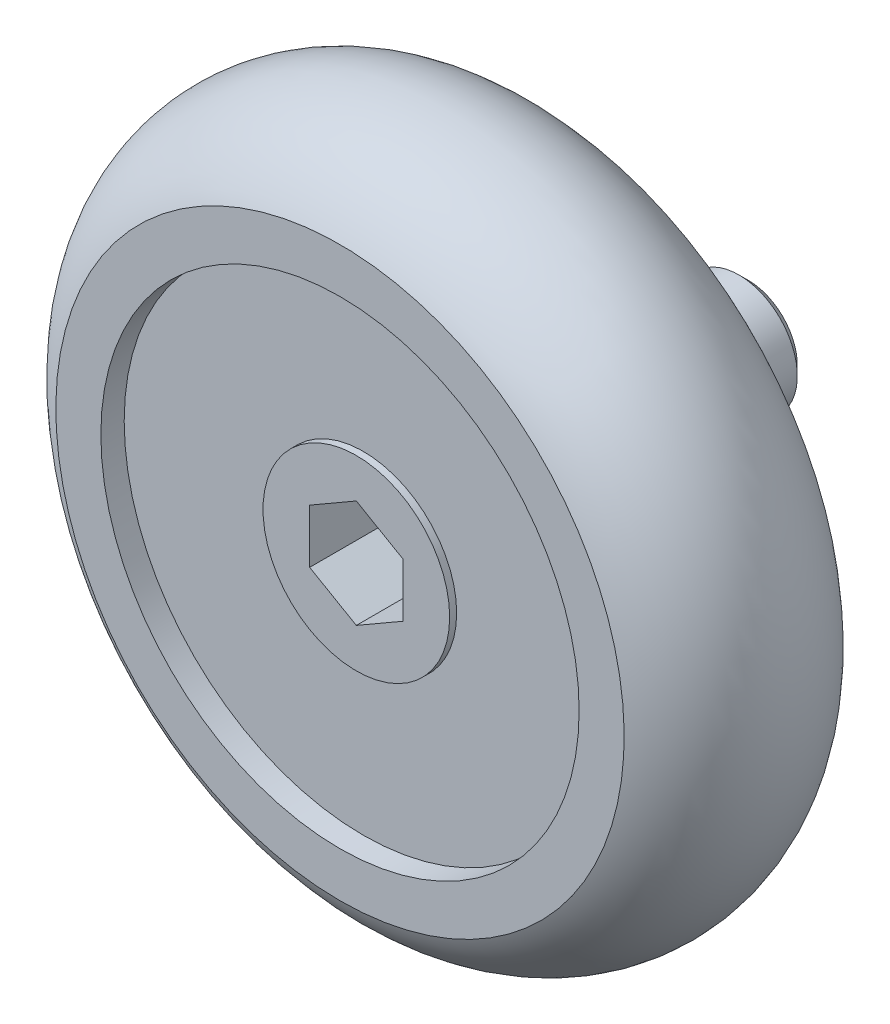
ISO-10303-21;
HEADER;
FILE_DESCRIPTION(('STEP AP214'),'2;1');
FILE_NAME('part.step','',(''),(''),'','','');
FILE_SCHEMA(('AUTOMOTIVE_DESIGN { 1 0 10303 214 1 1 1 1 }'));
ENDSEC;
DATA;
#1=APPLICATION_CONTEXT('core data for automotive mechanical design processes');
#2=APPLICATION_PROTOCOL_DEFINITION('international standard','automotive_design',2000,#1);
#3=PRODUCT_CONTEXT('',#1,'mechanical');
#4=PRODUCT('Part','Part','',(#3));
#5=PRODUCT_RELATED_PRODUCT_CATEGORY('part','',(#4));
#6=PRODUCT_DEFINITION_FORMATION('','',#4);
#7=PRODUCT_DEFINITION_CONTEXT('part definition',#1,'design');
#8=PRODUCT_DEFINITION('design','',#6,#7);
#9=PRODUCT_DEFINITION_SHAPE('','',#8);
#10=(LENGTH_UNIT() NAMED_UNIT(*) SI_UNIT(.MILLI.,.METRE.));
#11=(NAMED_UNIT(*) PLANE_ANGLE_UNIT() SI_UNIT($,.RADIAN.));
#12=(NAMED_UNIT(*) SI_UNIT($,.STERADIAN.) SOLID_ANGLE_UNIT());
#13=UNCERTAINTY_MEASURE_WITH_UNIT(LENGTH_MEASURE(1.E-05),#10,'distance_accuracy_value','');
#14=(GEOMETRIC_REPRESENTATION_CONTEXT(3) GLOBAL_UNCERTAINTY_ASSIGNED_CONTEXT((#13)) GLOBAL_UNIT_ASSIGNED_CONTEXT((#10,
#11,#12)) REPRESENTATION_CONTEXT('',''));
#15=CARTESIAN_POINT('',(0.,0.,0.));
#16=DIRECTION('',(0.,0.,1.));
#17=DIRECTION('',(1.,0.,0.));
#18=AXIS2_PLACEMENT_3D('',#15,#16,#17);
#19=CARTESIAN_POINT('',(0.,12.1794490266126,0.500000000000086));
#20=DIRECTION('',(0.,0.,-1.));
#21=DIRECTION('',(-1.,0.,0.));
#22=AXIS2_PLACEMENT_3D('',#19,#20,#21);
#23=PLANE('',#22);
#24=CARTESIAN_POINT('',(0.,0.,0.500000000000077));
#25=DIRECTION('',(0.,0.,1.));
#26=DIRECTION('',(0.,-1.,0.));
#27=AXIS2_PLACEMENT_3D('',#24,#25,#26);
#28=CIRCLE('',#27,12.1794494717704);
#29=CARTESIAN_POINT('',(0.,-12.1794494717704,0.500000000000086));
#30=VERTEX_POINT('',#29);
#31=EDGE_CURVE('E117',#30,#30,#28,.T.);
#32=ORIENTED_EDGE('',*,*,#31,.F.);
#33=EDGE_LOOP('',(#32));
#34=FACE_BOUND('',#33,.T.);
#35=CARTESIAN_POINT('',(0.,0.,0.50000000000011));
#36=DIRECTION('',(0.,0.,1.));
#37=DIRECTION('',(1.,0.,0.));
#38=AXIS2_PLACEMENT_3D('',#35,#36,#37);
#39=CIRCLE('',#38,10.25);
#40=CARTESIAN_POINT('',(10.25,0.,0.50000000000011));
#41=VERTEX_POINT('',#40);
#42=EDGE_CURVE('E9',#41,#41,#39,.T.);
#43=ORIENTED_EDGE('',*,*,#42,.T.);
#44=EDGE_LOOP('',(#43));
#45=FACE_BOUND('',#44,.T.);
#46=ADVANCED_FACE('F14',(#34,#45),#23,.T.);
#47=CARTESIAN_POINT('',(0.,0.,12.5));
#48=DIRECTION('',(0.,0.,1.));
#49=DIRECTION('',(1.,0.,0.));
#50=AXIS2_PLACEMENT_3D('',#47,#48,#49);
#51=CYLINDRICAL_SURFACE('',#50,10.25);
#52=CARTESIAN_POINT('',(0.,0.,1.5));
#53=DIRECTION('',(0.,0.,1.));
#54=DIRECTION('',(1.,0.,0.));
#55=AXIS2_PLACEMENT_3D('',#52,#53,#54);
#56=CIRCLE('',#55,10.25);
#57=CARTESIAN_POINT('',(10.25,0.,1.5));
#58=VERTEX_POINT('',#57);
#59=EDGE_CURVE('E21',#58,#58,#56,.T.);
#60=ORIENTED_EDGE('',*,*,#59,.T.);
#61=EDGE_LOOP('',(#60));
#62=FACE_BOUND('',#61,.T.);
#63=ORIENTED_EDGE('',*,*,#42,.F.);
#64=EDGE_LOOP('',(#63));
#65=FACE_BOUND('',#64,.T.);
#66=ADVANCED_FACE('F137',(#62,#65),#51,.F.);
#67=CARTESIAN_POINT('',(0.,5.1,1.5));
#68=DIRECTION('',(0.,0.,-1.));
#69=DIRECTION('',(-1.,0.,0.));
#70=AXIS2_PLACEMENT_3D('',#67,#68,#69);
#71=PLANE('',#70);
#72=ORIENTED_EDGE('',*,*,#59,.F.);
#73=EDGE_LOOP('',(#72));
#74=FACE_BOUND('',#73,.T.);
#75=CARTESIAN_POINT('',(0.,0.,1.5));
#76=DIRECTION('',(0.,0.,-1.));
#77=DIRECTION('',(-1.,0.,0.));
#78=AXIS2_PLACEMENT_3D('',#75,#76,#77);
#79=CIRCLE('',#78,5.);
#80=CARTESIAN_POINT('',(-5.,0.,1.5));
#81=VERTEX_POINT('',#80);
#82=EDGE_CURVE('E85',#81,#81,#79,.F.);
#83=ORIENTED_EDGE('',*,*,#82,.T.);
#84=EDGE_LOOP('',(#83));
#85=FACE_BOUND('',#84,.T.);
#86=ADVANCED_FACE('F140',(#74,#85),#71,.T.);
#87=CARTESIAN_POINT('',(0.,0.,5.));
#88=DIRECTION('',(0.,0.,1.));
#89=DIRECTION('',(0.,-1.,0.));
#90=AXIS2_PLACEMENT_3D('',#87,#88,#89);
#91=TOROIDAL_SURFACE('',#90,10.,5.);
#92=ORIENTED_EDGE('',*,*,#31,.T.);
#93=EDGE_LOOP('',(#92));
#94=FACE_BOUND('',#93,.T.);
#95=CARTESIAN_POINT('',(0.,0.,9.5));
#96=DIRECTION('',(0.,0.,1.));
#97=DIRECTION('',(0.,-1.,0.));
#98=AXIS2_PLACEMENT_3D('',#95,#96,#97);
#99=CIRCLE('',#98,12.1794494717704);
#100=CARTESIAN_POINT('',(0.,-12.1794494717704,9.50000000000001));
#101=VERTEX_POINT('',#100);
#102=EDGE_CURVE('E120',#101,#101,#99,.T.);
#103=ORIENTED_EDGE('',*,*,#102,.F.);
#104=EDGE_LOOP('',(#103));
#105=FACE_BOUND('',#104,.T.);
#106=ADVANCED_FACE('F143',(#94,#105),#91,.T.);
#107=CARTESIAN_POINT('',(0.,4.0000000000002,8.8));
#108=DIRECTION('',(0.,0.,1.));
#109=DIRECTION('',(1.,0.,0.));
#110=AXIS2_PLACEMENT_3D('',#107,#108,#109);
#111=PLANE('',#110);
#112=CARTESIAN_POINT('',(0.,0.,8.8));
#113=DIRECTION('',(0.,0.,1.));
#114=DIRECTION('',(1.,0.,0.));
#115=AXIS2_PLACEMENT_3D('',#112,#113,#114);
#116=CIRCLE('',#115,4.0000000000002);
#117=CARTESIAN_POINT('',(4.0000000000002,0.,8.8));
#118=VERTEX_POINT('',#117);
#119=EDGE_CURVE('E132',#118,#118,#116,.T.);
#120=ORIENTED_EDGE('',*,*,#119,.T.);
#121=EDGE_LOOP('',(#120));
#122=FACE_BOUND('',#121,.T.);
#123=DIRECTION('',(0.866025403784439,-0.5,0.));
#124=VECTOR('',#123,1.);
#125=CARTESIAN_POINT('',(-2.,-1.15470053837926,8.8));
#126=LINE('',#125,#124);
#127=CARTESIAN_POINT('',(-2.,-1.15470053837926,8.8));
#128=VERTEX_POINT('',#127);
#129=CARTESIAN_POINT('',(0.,-2.30940107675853,8.8));
#130=VERTEX_POINT('',#129);
#131=EDGE_CURVE('E70',#128,#130,#126,.T.);
#132=ORIENTED_EDGE('',*,*,#131,.F.);
#133=DIRECTION('',(0.,-1.,0.));
#134=VECTOR('',#133,1.);
#135=CARTESIAN_POINT('',(-2.,1.15470053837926,8.8));
#136=LINE('',#135,#134);
#137=CARTESIAN_POINT('',(-2.,1.15470053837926,8.8));
#138=VERTEX_POINT('',#137);
#139=EDGE_CURVE('E64',#138,#128,#136,.T.);
#140=ORIENTED_EDGE('',*,*,#139,.F.);
#141=DIRECTION('',(-0.866025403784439,-0.5,0.));
#142=VECTOR('',#141,1.);
#143=CARTESIAN_POINT('',(0.,2.30940107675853,8.8));
#144=LINE('',#143,#142);
#145=CARTESIAN_POINT('',(0.,2.30940107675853,8.8));
#146=VERTEX_POINT('',#145);
#147=EDGE_CURVE('E67',#146,#138,#144,.T.);
#148=ORIENTED_EDGE('',*,*,#147,.F.);
#149=DIRECTION('',(-0.866025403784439,0.5,0.));
#150=VECTOR('',#149,1.);
#151=CARTESIAN_POINT('',(2.,1.15470053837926,8.8));
#152=LINE('',#151,#150);
#153=CARTESIAN_POINT('',(2.,1.15470053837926,8.8));
#154=VERTEX_POINT('',#153);
#155=EDGE_CURVE('E84',#154,#146,#152,.T.);
#156=ORIENTED_EDGE('',*,*,#155,.F.);
#157=DIRECTION('',(0.,1.,0.));
#158=VECTOR('',#157,1.);
#159=CARTESIAN_POINT('',(2.,-1.15470053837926,8.8));
#160=LINE('',#159,#158);
#161=CARTESIAN_POINT('',(2.,-1.15470053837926,8.8));
#162=VERTEX_POINT('',#161);
#163=EDGE_CURVE('E154',#162,#154,#160,.T.);
#164=ORIENTED_EDGE('',*,*,#163,.F.);
#165=DIRECTION('',(0.866025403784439,0.5,0.));
#166=VECTOR('',#165,1.);
#167=CARTESIAN_POINT('',(0.,-2.30940107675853,8.8));
#168=LINE('',#167,#166);
#169=EDGE_CURVE('E157',#130,#162,#168,.T.);
#170=ORIENTED_EDGE('',*,*,#169,.F.);
#171=EDGE_LOOP('',(#132,#140,#148,#156,#164,#170));
#172=FACE_BOUND('',#171,.T.);
#173=ADVANCED_FACE('F66',(#122,#172),#111,.T.);
#174=CARTESIAN_POINT('',(0.,0.,12.5));
#175=DIRECTION('',(0.,0.,1.));
#176=DIRECTION('',(1.,0.,0.));
#177=AXIS2_PLACEMENT_3D('',#174,#175,#176);
#178=CYLINDRICAL_SURFACE('',#177,4.0000000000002);
#179=CARTESIAN_POINT('',(0.,0.,8.49999999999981));
#180=DIRECTION('',(0.,0.,1.));
#181=DIRECTION('',(1.,0.,0.));
#182=AXIS2_PLACEMENT_3D('',#179,#180,#181);
#183=CIRCLE('',#182,4.0000000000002);
#184=CARTESIAN_POINT('',(4.0000000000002,0.,8.49999999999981));
#185=VERTEX_POINT('',#184);
#186=EDGE_CURVE('E129',#185,#185,#183,.T.);
#187=ORIENTED_EDGE('',*,*,#186,.T.);
#188=EDGE_LOOP('',(#187));
#189=FACE_BOUND('',#188,.T.);
#190=ORIENTED_EDGE('',*,*,#119,.F.);
#191=EDGE_LOOP('',(#190));
#192=FACE_BOUND('',#191,.T.);
#193=ADVANCED_FACE('F224',(#189,#192),#178,.T.);
#194=CARTESIAN_POINT('',(0.,10.25,8.5));
#195=DIRECTION('',(0.,0.,1.));
#196=DIRECTION('',(1.,0.,0.));
#197=AXIS2_PLACEMENT_3D('',#194,#195,#196);
#198=PLANE('',#197);
#199=CARTESIAN_POINT('',(0.,0.,8.5));
#200=DIRECTION('',(0.,0.,1.));
#201=DIRECTION('',(1.,0.,0.));
#202=AXIS2_PLACEMENT_3D('',#199,#200,#201);
#203=CIRCLE('',#202,10.25);
#204=CARTESIAN_POINT('',(10.25,0.,8.5));
#205=VERTEX_POINT('',#204);
#206=EDGE_CURVE('E126',#205,#205,#203,.T.);
#207=ORIENTED_EDGE('',*,*,#206,.T.);
#208=EDGE_LOOP('',(#207));
#209=FACE_BOUND('',#208,.T.);
#210=ORIENTED_EDGE('',*,*,#186,.F.);
#211=EDGE_LOOP('',(#210));
#212=FACE_BOUND('',#211,.T.);
#213=ADVANCED_FACE('F216',(#209,#212),#198,.T.);
#214=CARTESIAN_POINT('',(0.,0.,12.5));
#215=DIRECTION('',(0.,0.,1.));
#216=DIRECTION('',(1.,0.,0.));
#217=AXIS2_PLACEMENT_3D('',#214,#215,#216);
#218=CYLINDRICAL_SURFACE('',#217,10.25);
#219=CARTESIAN_POINT('',(0.,0.,9.5));
#220=DIRECTION('',(0.,0.,1.));
#221=DIRECTION('',(1.,0.,0.));
#222=AXIS2_PLACEMENT_3D('',#219,#220,#221);
#223=CIRCLE('',#222,10.25);
#224=CARTESIAN_POINT('',(10.25,0.,9.5));
#225=VERTEX_POINT('',#224);
#226=EDGE_CURVE('E123',#225,#225,#223,.T.);
#227=ORIENTED_EDGE('',*,*,#226,.T.);
#228=EDGE_LOOP('',(#227));
#229=FACE_BOUND('',#228,.T.);
#230=ORIENTED_EDGE('',*,*,#206,.F.);
#231=EDGE_LOOP('',(#230));
#232=FACE_BOUND('',#231,.T.);
#233=ADVANCED_FACE('F208',(#229,#232),#218,.F.);
#234=CARTESIAN_POINT('',(0.,12.1794489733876,9.5));
#235=DIRECTION('',(0.,0.,1.));
#236=DIRECTION('',(1.,0.,0.));
#237=AXIS2_PLACEMENT_3D('',#234,#235,#236);
#238=PLANE('',#237);
#239=ORIENTED_EDGE('',*,*,#226,.F.);
#240=EDGE_LOOP('',(#239));
#241=FACE_BOUND('',#240,.T.);
#242=ORIENTED_EDGE('',*,*,#102,.T.);
#243=EDGE_LOOP('',(#242));
#244=FACE_BOUND('',#243,.T.);
#245=ADVANCED_FACE('F206',(#241,#244),#238,.T.);
#246=CARTESIAN_POINT('',(-2.,1.15470053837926,16.4376261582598));
#247=DIRECTION('',(1.,0.,0.));
#248=DIRECTION('',(0.,0.,-1.));
#249=AXIS2_PLACEMENT_3D('',#246,#247,#248);
#250=PLANE('',#249);
#251=DIRECTION('',(0.,0.,-1.));
#252=VECTOR('',#251,1.);
#253=CARTESIAN_POINT('',(-2.,1.15470053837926,16.4376261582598));
#254=LINE('',#253,#252);
#255=CARTESIAN_POINT('',(-2.,1.15470053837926,5.3));
#256=VERTEX_POINT('',#255);
#257=EDGE_CURVE('E80',#138,#256,#254,.T.);
#258=ORIENTED_EDGE('',*,*,#257,.F.);
#259=ORIENTED_EDGE('',*,*,#139,.T.);
#260=DIRECTION('',(0.,0.,-1.));
#261=VECTOR('',#260,1.);
#262=CARTESIAN_POINT('',(-2.,-1.15470053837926,16.4376261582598));
#263=LINE('',#262,#261);
#264=CARTESIAN_POINT('',(-2.,-1.15470053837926,5.3));
#265=VERTEX_POINT('',#264);
#266=EDGE_CURVE('E89',#128,#265,#263,.T.);
#267=ORIENTED_EDGE('',*,*,#266,.T.);
#268=DIRECTION('',(0.,-1.,0.));
#269=VECTOR('',#268,1.);
#270=CARTESIAN_POINT('',(-2.,1.15470053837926,5.3));
#271=LINE('',#270,#269);
#272=EDGE_CURVE('E88',#256,#265,#271,.T.);
#273=ORIENTED_EDGE('',*,*,#272,.F.);
#274=EDGE_LOOP('',(#258,#259,#267,#273));
#275=FACE_BOUND('',#274,.T.);
#276=ADVANCED_FACE('F87',(#275),#250,.T.);
#277=CARTESIAN_POINT('',(0.,2.30940107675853,16.4376261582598));
#278=DIRECTION('',(0.5,-0.866025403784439,0.));
#279=DIRECTION('',(0.866025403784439,0.5,0.));
#280=AXIS2_PLACEMENT_3D('',#277,#278,#279);
#281=PLANE('',#280);
#282=DIRECTION('',(0.,0.,-1.));
#283=VECTOR('',#282,1.);
#284=CARTESIAN_POINT('',(0.,2.30940107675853,16.4376261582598));
#285=LINE('',#284,#283);
#286=CARTESIAN_POINT('',(0.,2.30940107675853,5.3));
#287=VERTEX_POINT('',#286);
#288=EDGE_CURVE('E82',#146,#287,#285,.T.);
#289=ORIENTED_EDGE('',*,*,#288,.F.);
#290=ORIENTED_EDGE('',*,*,#147,.T.);
#291=ORIENTED_EDGE('',*,*,#257,.T.);
#292=DIRECTION('',(-0.866025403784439,-0.5,0.));
#293=VECTOR('',#292,1.);
#294=CARTESIAN_POINT('',(0.,2.30940107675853,5.3));
#295=LINE('',#294,#293);
#296=EDGE_CURVE('E28',#287,#256,#295,.T.);
#297=ORIENTED_EDGE('',*,*,#296,.F.);
#298=EDGE_LOOP('',(#289,#290,#291,#297));
#299=FACE_BOUND('',#298,.T.);
#300=ADVANCED_FACE('F79',(#299),#281,.T.);
#301=CARTESIAN_POINT('',(2.,1.15470053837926,16.4376261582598));
#302=DIRECTION('',(-0.5,-0.866025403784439,0.));
#303=DIRECTION('',(0.866025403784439,-0.5,0.));
#304=AXIS2_PLACEMENT_3D('',#301,#302,#303);
#305=PLANE('',#304);
#306=DIRECTION('',(0.,0.,-1.));
#307=VECTOR('',#306,1.);
#308=CARTESIAN_POINT('',(2.,1.15470053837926,16.4376261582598));
#309=LINE('',#308,#307);
#310=CARTESIAN_POINT('',(2.,1.15470053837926,5.3));
#311=VERTEX_POINT('',#310);
#312=EDGE_CURVE('E91',#154,#311,#309,.T.);
#313=ORIENTED_EDGE('',*,*,#312,.F.);
#314=ORIENTED_EDGE('',*,*,#155,.T.);
#315=ORIENTED_EDGE('',*,*,#288,.T.);
#316=DIRECTION('',(-0.866025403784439,0.5,0.));
#317=VECTOR('',#316,1.);
#318=CARTESIAN_POINT('',(2.,1.15470053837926,5.3));
#319=LINE('',#318,#317);
#320=EDGE_CURVE('E33',#311,#287,#319,.T.);
#321=ORIENTED_EDGE('',*,*,#320,.F.);
#322=EDGE_LOOP('',(#313,#314,#315,#321));
#323=FACE_BOUND('',#322,.T.);
#324=ADVANCED_FACE('F182',(#323),#305,.T.);
#325=CARTESIAN_POINT('',(2.,-1.15470053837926,16.4376261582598));
#326=DIRECTION('',(-1.,0.,0.));
#327=DIRECTION('',(0.,0.,1.));
#328=AXIS2_PLACEMENT_3D('',#325,#326,#327);
#329=PLANE('',#328);
#330=DIRECTION('',(0.,0.,-1.));
#331=VECTOR('',#330,1.);
#332=CARTESIAN_POINT('',(2.,-1.15470053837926,16.4376261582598));
#333=LINE('',#332,#331);
#334=CARTESIAN_POINT('',(2.,-1.15470053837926,5.3));
#335=VERTEX_POINT('',#334);
#336=EDGE_CURVE('E98',#162,#335,#333,.T.);
#337=ORIENTED_EDGE('',*,*,#336,.F.);
#338=ORIENTED_EDGE('',*,*,#163,.T.);
#339=ORIENTED_EDGE('',*,*,#312,.T.);
#340=DIRECTION('',(0.,1.,0.));
#341=VECTOR('',#340,1.);
#342=CARTESIAN_POINT('',(2.,-1.15470053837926,5.3));
#343=LINE('',#342,#341);
#344=EDGE_CURVE('E165',#335,#311,#343,.T.);
#345=ORIENTED_EDGE('',*,*,#344,.F.);
#346=EDGE_LOOP('',(#337,#338,#339,#345));
#347=FACE_BOUND('',#346,.T.);
#348=ADVANCED_FACE('F180',(#347),#329,.T.);
#349=CARTESIAN_POINT('',(0.,-2.30940107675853,16.4376261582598));
#350=DIRECTION('',(-0.5,0.866025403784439,0.));
#351=DIRECTION('',(-0.866025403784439,-0.5,0.));
#352=AXIS2_PLACEMENT_3D('',#349,#350,#351);
#353=PLANE('',#352);
#354=DIRECTION('',(0.,0.,-1.));
#355=VECTOR('',#354,1.);
#356=CARTESIAN_POINT('',(0.,-2.30940107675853,16.4376261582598));
#357=LINE('',#356,#355);
#358=CARTESIAN_POINT('',(0.,-2.30940107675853,5.3));
#359=VERTEX_POINT('',#358);
#360=EDGE_CURVE('E76',#130,#359,#357,.T.);
#361=ORIENTED_EDGE('',*,*,#360,.F.);
#362=ORIENTED_EDGE('',*,*,#169,.T.);
#363=ORIENTED_EDGE('',*,*,#336,.T.);
#364=DIRECTION('',(0.866025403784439,0.5,0.));
#365=VECTOR('',#364,1.);
#366=CARTESIAN_POINT('',(0.,-2.30940107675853,5.3));
#367=LINE('',#366,#365);
#368=EDGE_CURVE('E163',#359,#335,#367,.T.);
#369=ORIENTED_EDGE('',*,*,#368,.F.);
#370=EDGE_LOOP('',(#361,#362,#363,#369));
#371=FACE_BOUND('',#370,.T.);
#372=ADVANCED_FACE('F175',(#371),#353,.T.);
#373=CARTESIAN_POINT('',(-2.,-1.15470053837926,16.4376261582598));
#374=DIRECTION('',(0.5,0.866025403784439,0.));
#375=DIRECTION('',(-0.866025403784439,0.5,0.));
#376=AXIS2_PLACEMENT_3D('',#373,#374,#375);
#377=PLANE('',#376);
#378=ORIENTED_EDGE('',*,*,#266,.F.);
#379=ORIENTED_EDGE('',*,*,#131,.T.);
#380=ORIENTED_EDGE('',*,*,#360,.T.);
#381=DIRECTION('',(0.866025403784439,-0.5,0.));
#382=VECTOR('',#381,1.);
#383=CARTESIAN_POINT('',(-2.,-1.15470053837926,5.3));
#384=LINE('',#383,#382);
#385=EDGE_CURVE('E161',#265,#359,#384,.T.);
#386=ORIENTED_EDGE('',*,*,#385,.F.);
#387=EDGE_LOOP('',(#378,#379,#380,#386));
#388=FACE_BOUND('',#387,.T.);
#389=ADVANCED_FACE('F171',(#388),#377,.T.);
#390=CARTESIAN_POINT('',(0.,0.,5.3));
#391=DIRECTION('',(0.,0.,1.));
#392=DIRECTION('',(1.,0.,0.));
#393=AXIS2_PLACEMENT_3D('',#390,#391,#392);
#394=PLANE('',#393);
#395=ORIENTED_EDGE('',*,*,#272,.T.);
#396=ORIENTED_EDGE('',*,*,#385,.T.);
#397=ORIENTED_EDGE('',*,*,#368,.T.);
#398=ORIENTED_EDGE('',*,*,#344,.T.);
#399=ORIENTED_EDGE('',*,*,#320,.T.);
#400=ORIENTED_EDGE('',*,*,#296,.T.);
#401=EDGE_LOOP('',(#395,#396,#397,#398,#399,#400));
#402=FACE_BOUND('',#401,.T.);
#403=ADVANCED_FACE('F168',(#402),#394,.T.);
#404=CARTESIAN_POINT('',(0.,0.,20.3079524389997));
#405=DIRECTION('',(0.,0.,-1.));
#406=DIRECTION('',(-1.,0.,0.));
#407=AXIS2_PLACEMENT_3D('',#404,#405,#406);
#408=CYLINDRICAL_SURFACE('',#407,5.);
#409=ORIENTED_EDGE('',*,*,#82,.F.);
#410=EDGE_LOOP('',(#409));
#411=FACE_BOUND('',#410,.T.);
#412=CARTESIAN_POINT('',(0.,0.,0.));
#413=DIRECTION('',(0.,0.,-1.));
#414=DIRECTION('',(-1.,0.,0.));
#415=AXIS2_PLACEMENT_3D('',#412,#413,#414);
#416=CIRCLE('',#415,5.);
#417=CARTESIAN_POINT('',(-5.,0.,0.));
#418=VERTEX_POINT('',#417);
#419=EDGE_CURVE('E148',#418,#418,#416,.T.);
#420=ORIENTED_EDGE('',*,*,#419,.F.);
#421=EDGE_LOOP('',(#420));
#422=FACE_BOUND('',#421,.T.);
#423=ADVANCED_FACE('F314',(#411,#422),#408,.T.);
#424=CARTESIAN_POINT('',(0.,0.,-8.));
#425=DIRECTION('',(0.,0.,-1.));
#426=DIRECTION('',(-1.,0.,0.));
#427=AXIS2_PLACEMENT_3D('',#424,#425,#426);
#428=PLANE('',#427);
#429=CARTESIAN_POINT('',(0.,0.,-8.));
#430=DIRECTION('',(0.,0.,-1.));
#431=DIRECTION('',(-1.,0.,0.));
#432=AXIS2_PLACEMENT_3D('',#429,#430,#431);
#433=CIRCLE('',#432,2.1);
#434=CARTESIAN_POINT('',(-2.1,0.,-8.));
#435=VERTEX_POINT('',#434);
#436=EDGE_CURVE('E75',#435,#435,#433,.T.);
#437=ORIENTED_EDGE('',*,*,#436,.T.);
#438=EDGE_LOOP('',(#437));
#439=FACE_BOUND('',#438,.T.);
#440=ADVANCED_FACE('F323',(#439),#428,.T.);
#441=CARTESIAN_POINT('',(0.,0.,-7.6));
#442=DIRECTION('',(0.,0.,1.));
#443=DIRECTION('',(1.,0.,0.));
#444=AXIS2_PLACEMENT_3D('',#441,#442,#443);
#445=CONICAL_SURFACE('',#444,2.5,0.785398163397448);
#446=ORIENTED_EDGE('',*,*,#436,.F.);
#447=EDGE_LOOP('',(#446));
#448=FACE_BOUND('',#447,.T.);
#449=CARTESIAN_POINT('',(0.,0.,-7.6));
#450=DIRECTION('',(0.,0.,-1.));
#451=DIRECTION('',(-1.,0.,0.));
#452=AXIS2_PLACEMENT_3D('',#449,#450,#451);
#453=CIRCLE('',#452,2.5);
#454=CARTESIAN_POINT('',(-2.5,0.,-7.6));
#455=VERTEX_POINT('',#454);
#456=EDGE_CURVE('E105',#455,#455,#453,.T.);
#457=ORIENTED_EDGE('',*,*,#456,.T.);
#458=EDGE_LOOP('',(#457));
#459=FACE_BOUND('',#458,.T.);
#460=ADVANCED_FACE('F331',(#448,#459),#445,.T.);
#461=CARTESIAN_POINT('',(0.,0.,-8.));
#462=DIRECTION('',(0.,0.,-1.));
#463=DIRECTION('',(-1.,0.,0.));
#464=AXIS2_PLACEMENT_3D('',#461,#462,#463);
#465=CYLINDRICAL_SURFACE('',#464,2.5);
#466=ORIENTED_EDGE('',*,*,#456,.F.);
#467=EDGE_LOOP('',(#466));
#468=FACE_BOUND('',#467,.T.);
#469=CARTESIAN_POINT('',(0.,0.,-1.6));
#470=DIRECTION('',(0.,0.,-1.));
#471=DIRECTION('',(-1.,0.,0.));
#472=AXIS2_PLACEMENT_3D('',#469,#470,#471);
#473=CIRCLE('',#472,2.5);
#474=CARTESIAN_POINT('',(-2.5,0.,-1.6));
#475=VERTEX_POINT('',#474);
#476=EDGE_CURVE('E108',#475,#475,#473,.T.);
#477=ORIENTED_EDGE('',*,*,#476,.T.);
#478=EDGE_LOOP('',(#477));
#479=FACE_BOUND('',#478,.T.);
#480=ADVANCED_FACE('F341',(#468,#479),#465,.T.);
#481=CARTESIAN_POINT('',(0.,2.,-1.6));
#482=DIRECTION('',(0.,0.,-1.));
#483=DIRECTION('',(-1.,0.,0.));
#484=AXIS2_PLACEMENT_3D('',#481,#482,#483);
#485=PLANE('',#484);
#486=ORIENTED_EDGE('',*,*,#476,.F.);
#487=EDGE_LOOP('',(#486));
#488=FACE_BOUND('',#487,.T.);
#489=CARTESIAN_POINT('',(0.,0.,-1.6));
#490=DIRECTION('',(0.,0.,-1.));
#491=DIRECTION('',(-1.,0.,0.));
#492=AXIS2_PLACEMENT_3D('',#489,#490,#491);
#493=CIRCLE('',#492,2.);
#494=CARTESIAN_POINT('',(-2.,0.,-1.6));
#495=VERTEX_POINT('',#494);
#496=EDGE_CURVE('E111',#495,#495,#493,.T.);
#497=ORIENTED_EDGE('',*,*,#496,.T.);
#498=EDGE_LOOP('',(#497));
#499=FACE_BOUND('',#498,.T.);
#500=ADVANCED_FACE('F351',(#488,#499),#485,.F.);
#501=CARTESIAN_POINT('',(0.,0.,-8.));
#502=DIRECTION('',(0.,0.,-1.));
#503=DIRECTION('',(-1.,0.,0.));
#504=AXIS2_PLACEMENT_3D('',#501,#502,#503);
#505=CYLINDRICAL_SURFACE('',#504,2.);
#506=ORIENTED_EDGE('',*,*,#496,.F.);
#507=EDGE_LOOP('',(#506));
#508=FACE_BOUND('',#507,.T.);
#509=CARTESIAN_POINT('',(0.,0.,0.));
#510=DIRECTION('',(0.,0.,-1.));
#511=DIRECTION('',(-1.,0.,0.));
#512=AXIS2_PLACEMENT_3D('',#509,#510,#511);
#513=CIRCLE('',#512,2.);
#514=CARTESIAN_POINT('',(-2.,0.,0.));
#515=VERTEX_POINT('',#514);
#516=EDGE_CURVE('E114',#515,#515,#513,.T.);
#517=ORIENTED_EDGE('',*,*,#516,.T.);
#518=EDGE_LOOP('',(#517));
#519=FACE_BOUND('',#518,.T.);
#520=ADVANCED_FACE('F361',(#508,#519),#505,.T.);
#521=CARTESIAN_POINT('',(0.,0.,0.));
#522=DIRECTION('',(0.,0.,-1.));
#523=DIRECTION('',(-1.,0.,0.));
#524=AXIS2_PLACEMENT_3D('',#521,#522,#523);
#525=PLANE('',#524);
#526=ORIENTED_EDGE('',*,*,#516,.F.);
#527=EDGE_LOOP('',(#526));
#528=FACE_BOUND('',#527,.T.);
#529=ORIENTED_EDGE('',*,*,#419,.T.);
#530=EDGE_LOOP('',(#529));
#531=FACE_BOUND('',#530,.T.);
#532=ADVANCED_FACE('F370',(#528,#531),#525,.T.);
#533=CLOSED_SHELL('',(#46,#66,#86,#106,#173,#193,#213,#233,#245,#276,#300,#324,#348,#372,#389,
#403,#423,#440,#460,#480,#500,#520,#532));
#534=MANIFOLD_SOLID_BREP('B1',#533);
#535=ADVANCED_BREP_SHAPE_REPRESENTATION('',(#18,#534),#14);
#536=SHAPE_DEFINITION_REPRESENTATION(#9,#535);
ENDSEC;
END-ISO-10303-21;
